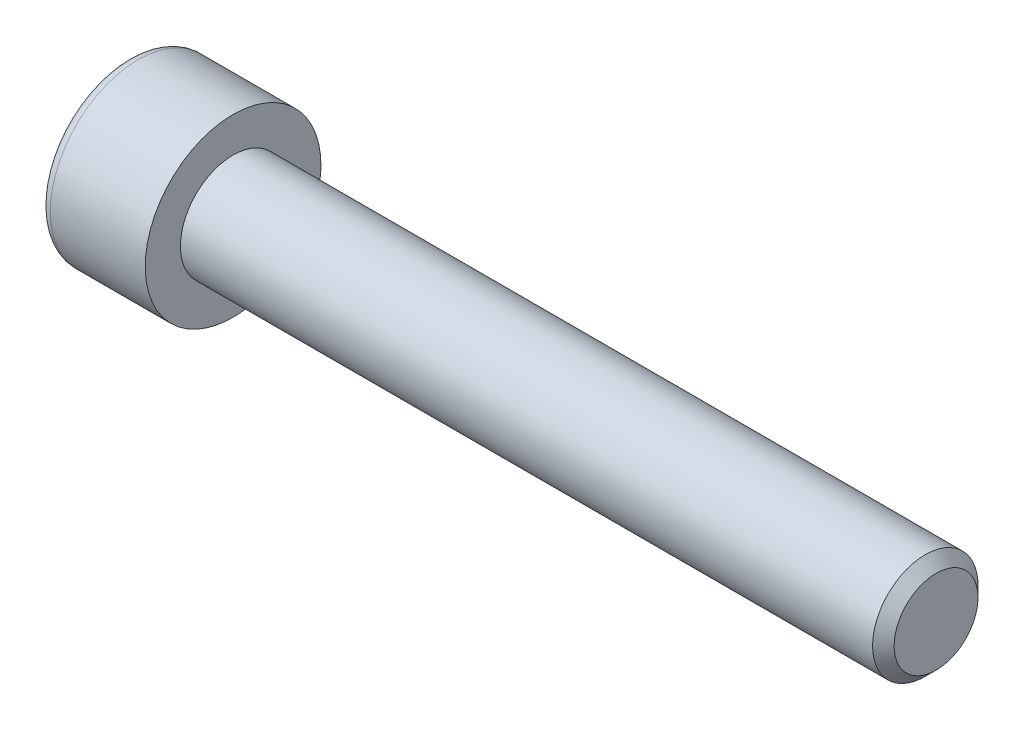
ISO-10303-21;
HEADER;
FILE_DESCRIPTION(('STEP AP214'),'2;1');
FILE_NAME('part.step','',(''),(''),'','','');
FILE_SCHEMA(('AUTOMOTIVE_DESIGN { 1 0 10303 214 1 1 1 1 }'));
ENDSEC;
DATA;
#1=APPLICATION_CONTEXT('core data for automotive mechanical design processes');
#2=APPLICATION_PROTOCOL_DEFINITION('international standard','automotive_design',2000,#1);
#3=PRODUCT_CONTEXT('',#1,'mechanical');
#4=PRODUCT('Part','Part','',(#3));
#5=PRODUCT_RELATED_PRODUCT_CATEGORY('part','',(#4));
#6=PRODUCT_DEFINITION_FORMATION('','',#4);
#7=PRODUCT_DEFINITION_CONTEXT('part definition',#1,'design');
#8=PRODUCT_DEFINITION('design','',#6,#7);
#9=PRODUCT_DEFINITION_SHAPE('','',#8);
#10=(LENGTH_UNIT() NAMED_UNIT(*) SI_UNIT(.MILLI.,.METRE.));
#11=(NAMED_UNIT(*) PLANE_ANGLE_UNIT() SI_UNIT($,.RADIAN.));
#12=(NAMED_UNIT(*) SI_UNIT($,.STERADIAN.) SOLID_ANGLE_UNIT());
#13=UNCERTAINTY_MEASURE_WITH_UNIT(LENGTH_MEASURE(1.E-05),#10,'distance_accuracy_value','');
#14=(GEOMETRIC_REPRESENTATION_CONTEXT(3) GLOBAL_UNCERTAINTY_ASSIGNED_CONTEXT((#13)) GLOBAL_UNIT_ASSIGNED_CONTEXT((#10,
#11,#12)) REPRESENTATION_CONTEXT('',''));
#15=CARTESIAN_POINT('',(0.,0.,0.));
#16=DIRECTION('',(0.,0.,1.));
#17=DIRECTION('',(1.,0.,0.));
#18=AXIS2_PLACEMENT_3D('',#15,#16,#17);
#19=CARTESIAN_POINT('',(-1.33333333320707,-2.27373675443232E-10,0.));
#20=DIRECTION('',(-1.,0.,0.));
#21=DIRECTION('',(0.,0.,1.));
#22=AXIS2_PLACEMENT_3D('',#19,#20,#21);
#23=CONICAL_SURFACE('',#22,0.,1.04719755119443);
#24=CARTESIAN_POINT('',(-1.33333333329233,-2.55795384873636E-10,0.));
#25=VERTEX_POINT('',#24);
#26=VERTEX_LOOP('',#25);
#27=FACE_BOUND('',#26,.T.);
#28=CARTESIAN_POINT('',(-2.99999999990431,3.48197362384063E-11,-2.88675134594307));
#29=CARTESIAN_POINT('',(-2.9633694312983,-0.109859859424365,-2.8233237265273));
#30=CARTESIAN_POINT('',(-2.93005584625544,-0.220668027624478,-2.75934860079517));
#31=CARTESIAN_POINT('',(-2.8719079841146,-0.444202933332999,-2.63029066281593));
#32=CARTESIAN_POINT('',(-2.8470942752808,-0.556933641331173,-2.56520555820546));
#33=CARTESIAN_POINT('',(-2.80846994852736,-0.780998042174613,-2.43584191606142));
#34=CARTESIAN_POINT('',(-2.79440223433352,-0.892297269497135,-2.37158327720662));
#35=CARTESIAN_POINT('',(-2.77761145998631,-1.11541915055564,-2.24276379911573));
#36=CARTESIAN_POINT('',(-2.77487449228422,-1.22724099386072,-2.17820342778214));
#37=CARTESIAN_POINT('',(-2.78058286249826,-1.43616811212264,-2.05757929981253));
#38=CARTESIAN_POINT('',(-2.78762660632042,-1.53330473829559,-2.00149744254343));
#39=CARTESIAN_POINT('',(-2.8099466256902,-1.72694517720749,-1.88969908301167));
#40=CARTESIAN_POINT('',(-2.8252305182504,-1.82344832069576,-1.83398296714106));
#41=CARTESIAN_POINT('',(-2.86343729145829,-2.01748767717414,-1.72195429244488));
#42=CARTESIAN_POINT('',(-2.88652205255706,-2.11499934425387,-1.66565590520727));
#43=CARTESIAN_POINT('',(-2.93891470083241,-2.30856871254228,-1.5538985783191));
#44=CARTESIAN_POINT('',(-2.96821028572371,-2.40462889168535,-1.49843820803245));
#45=CARTESIAN_POINT('',(-2.99999999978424,-2.50000000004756,-1.44337567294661));
#46=B_SPLINE_CURVE_WITH_KNOTS('',3,(#28,#29,#30,#31,#32,#33,#34,#35,#36,#37,#38,#39,#40,#41,#42,
#43,#44,#45),.UNSPECIFIED.,.F.,.F.,(4,2,2,2,2,2,2,2,4),(0.,0.396270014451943,0.793492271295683,
1.18088450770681,1.5678011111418,1.9046347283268,2.24178024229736,2.58640202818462,
2.93034746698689),.UNSPECIFIED.);
#47=CARTESIAN_POINT('',(-2.99999999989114,0.,-2.88675134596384));
#48=VERTEX_POINT('',#47);
#49=CARTESIAN_POINT('',(-2.9999999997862,-2.50000000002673,-1.44337567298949));
#50=VERTEX_POINT('',#49);
#51=EDGE_CURVE('E125',#48,#50,#46,.T.);
#52=ORIENTED_EDGE('',*,*,#51,.T.);
#53=CARTESIAN_POINT('',(-2.99999999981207,-2.4999999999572,-1.44337567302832));
#54=CARTESIAN_POINT('',(-2.96579221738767,-2.49999999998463,-1.32488884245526));
#55=CARTESIAN_POINT('',(-2.93447402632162,-2.49999999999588,-1.20546467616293));
#56=CARTESIAN_POINT('',(-2.87912300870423,-2.50000000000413,-0.964676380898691));
#57=CARTESIAN_POINT('',(-2.85510648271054,-2.50000000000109,-0.843308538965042));
#58=CARTESIAN_POINT('',(-2.81648500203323,-2.49999999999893,-0.601934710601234));
#59=CARTESIAN_POINT('',(-2.80167413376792,-2.49999999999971,-0.481962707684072));
#60=CARTESIAN_POINT('',(-2.7817914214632,-2.50000000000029,-0.241326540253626));
#61=CARTESIAN_POINT('',(-2.77670900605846,-2.50000000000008,-0.120663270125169));
#62=CARTESIAN_POINT('',(-2.7767090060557,-2.49999999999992,0.120663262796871));
#63=CARTESIAN_POINT('',(-2.78179142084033,-2.49999999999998,0.241326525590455));
#64=CARTESIAN_POINT('',(-2.80167413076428,-2.50000000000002,0.481962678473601));
#65=CARTESIAN_POINT('',(-2.81648499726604,-2.50000000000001,0.601934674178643));
#66=CARTESIAN_POINT('',(-2.85510647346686,-2.49999999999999,0.843308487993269));
#67=CARTESIAN_POINT('',(-2.87912299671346,-2.5,0.96467632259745));
#68=CARTESIAN_POINT('',(-2.9344740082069,-2.5,1.2054646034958));
#69=CARTESIAN_POINT('',(-2.96579219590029,-2.50000000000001,1.32488876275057));
#70=CARTESIAN_POINT('',(-2.99999997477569,-2.5,1.44337558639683));
#71=B_SPLINE_CURVE_WITH_KNOTS('',3,(#53,#54,#55,#56,#57,#58,#59,#60,#61,#62,#63,#64,#65,#66,#67,
#68,#69,#70),.UNSPECIFIED.,.F.,.F.,(4,2,2,2,2,2,2,2,4),(0.,0.370091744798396,0.741003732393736,
1.10328857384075,1.46517951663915,1.82707043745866,2.18935525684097,2.56026722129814,
2.93035894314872),.UNSPECIFIED.);
#72=CARTESIAN_POINT('',(-2.99999999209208,-2.50000001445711,1.44337562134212));
#73=VERTEX_POINT('',#72);
#74=EDGE_CURVE('E271',#50,#73,#71,.T.);
#75=ORIENTED_EDGE('',*,*,#74,.T.);
#76=CARTESIAN_POINT('',(-3.00000000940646,-2.50000002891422,1.44337565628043));
#77=CARTESIAN_POINT('',(-2.96336944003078,-2.39014016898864,1.5068032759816));
#78=CARTESIAN_POINT('',(-2.93005585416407,-2.27933200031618,1.57077840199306));
#79=CARTESIAN_POINT('',(-2.87190799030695,-2.05579709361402,1.69983634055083));
#80=CARTESIAN_POINT('',(-2.84709428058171,-1.94306638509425,1.76492144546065));
#81=CARTESIAN_POINT('',(-2.8084699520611,-1.71900198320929,1.89428508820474));
#82=CARTESIAN_POINT('',(-2.79440223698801,-1.60770275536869,1.95854372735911));
#83=CARTESIAN_POINT('',(-2.77761146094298,-1.38458087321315,2.08736320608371));
#84=CARTESIAN_POINT('',(-2.7748744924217,-1.27275902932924,2.15192357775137));
#85=CARTESIAN_POINT('',(-2.78058286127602,-1.06383190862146,2.27254770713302));
#86=CARTESIAN_POINT('',(-2.78762660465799,-0.966695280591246,2.32862956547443));
#87=CARTESIAN_POINT('',(-2.80994662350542,-0.773054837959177,2.44042792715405));
#88=CARTESIAN_POINT('',(-2.82523051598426,-0.676551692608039,2.49614404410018));
#89=CARTESIAN_POINT('',(-2.86343728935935,-0.482512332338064,2.60817272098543));
#90=CARTESIAN_POINT('',(-2.88652205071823,-0.385000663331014,2.66447110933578));
#91=CARTESIAN_POINT('',(-2.93891469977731,-0.191431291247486,2.77622843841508));
#92=CARTESIAN_POINT('',(-2.96821028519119,-0.0953711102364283,2.83168880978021));
#93=CARTESIAN_POINT('',(-2.9999999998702,-3.56160262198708E-11,2.88675134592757));
#94=B_SPLINE_CURVE_WITH_KNOTS('',3,(#76,#77,#78,#79,#80,#81,#82,#83,#84,#85,#86,#87,#88,#89,#90,
#91,#92,#93),.UNSPECIFIED.,.F.,.F.,(4,2,2,2,2,2,2,2,4),(0.,0.396270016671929,0.793492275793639,
1.18088451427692,1.56780111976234,1.90463474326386,2.24178026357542,2.58640205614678,
2.93034750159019),.UNSPECIFIED.);
#95=CARTESIAN_POINT('',(-2.99999999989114,-6.29652373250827E-11,2.88675134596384));
#96=VERTEX_POINT('',#95);
#97=EDGE_CURVE('E279',#73,#96,#94,.T.);
#98=ORIENTED_EDGE('',*,*,#97,.T.);
#99=CARTESIAN_POINT('',(-2.99999999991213,-9.01837214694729E-11,2.8867513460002));
#100=CARTESIAN_POINT('',(-2.96336943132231,0.109859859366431,2.82332372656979));
#101=CARTESIAN_POINT('',(-2.93005584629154,0.220668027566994,2.75934860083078));
#102=CARTESIAN_POINT('',(-2.87190798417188,0.444202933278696,2.63029066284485));
#103=CARTESIAN_POINT('',(-2.84709427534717,0.556933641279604,2.56520555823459));
#104=CARTESIAN_POINT('',(-2.80846994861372,0.780998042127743,2.4358419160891));
#105=CARTESIAN_POINT('',(-2.79440223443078,0.892297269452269,2.37158327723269));
#106=CARTESIAN_POINT('',(-2.77761146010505,1.11541915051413,2.24276379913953));
#107=CARTESIAN_POINT('',(-2.77487449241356,1.22724099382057,2.17820342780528));
#108=CARTESIAN_POINT('',(-2.78058286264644,1.43616811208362,2.05757929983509));
#109=CARTESIAN_POINT('',(-2.78762660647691,1.53330473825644,2.00149744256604));
#110=CARTESIAN_POINT('',(-2.80994662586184,1.72694517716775,1.8896990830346));
#111=CARTESIAN_POINT('',(-2.8252305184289,1.82344832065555,1.83398296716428));
#112=CARTESIAN_POINT('',(-2.86343729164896,2.01748767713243,1.72195429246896));
#113=CARTESIAN_POINT('',(-2.88652205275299,2.11499934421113,1.66565590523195));
#114=CARTESIAN_POINT('',(-2.93891470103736,2.30856871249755,1.55389857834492));
#115=CARTESIAN_POINT('',(-2.96821028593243,2.40462889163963,1.49843820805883));
#116=CARTESIAN_POINT('',(-2.99999999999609,2.50000000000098,1.44337567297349));
#117=B_SPLINE_CURVE_WITH_KNOTS('',3,(#99,#100,#101,#102,#103,#104,#105,#106,#107,#108,#109,#110,
#111,#112,#113,#114,#115,#116),.UNSPECIFIED.,.F.,.F.,(4,2,2,2,2,2,2,2,4),(0.,0.396270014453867,
0.793492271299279,1.18088450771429,1.56780111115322,1.90463472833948,2.24178024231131,
2.58640202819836,2.93034746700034),.UNSPECIFIED.);
#118=CARTESIAN_POINT('',(-2.99999999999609,2.50000000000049,1.44337567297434));
#119=VERTEX_POINT('',#118);
#120=EDGE_CURVE('E282',#96,#119,#117,.T.);
#121=ORIENTED_EDGE('',*,*,#120,.T.);
#122=CARTESIAN_POINT('',(-2.99999999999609,2.5,1.4433756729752));
#123=CARTESIAN_POINT('',(-2.96579221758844,2.5,1.32488884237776));
#124=CARTESIAN_POINT('',(-2.93447402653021,2.5,1.20546467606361));
#125=CARTESIAN_POINT('',(-2.87912300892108,2.5,0.964676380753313));
#126=CARTESIAN_POINT('',(-2.85510648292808,2.5,0.843308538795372));
#127=CARTESIAN_POINT('',(-2.81648500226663,2.5,0.601934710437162));
#128=CARTESIAN_POINT('',(-2.80167413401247,2.5,0.481962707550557));
#129=CARTESIAN_POINT('',(-2.78179142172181,2.5,0.241326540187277));
#130=CARTESIAN_POINT('',(-2.77670900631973,2.5,0.120663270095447));
#131=CARTESIAN_POINT('',(-2.77670900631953,2.5,-0.12066327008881));
#132=CARTESIAN_POINT('',(-2.78179142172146,2.5,-0.241326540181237));
#133=CARTESIAN_POINT('',(-2.80167413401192,2.5,-0.481962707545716));
#134=CARTESIAN_POINT('',(-2.81648500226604,2.5,-0.601934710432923));
#135=CARTESIAN_POINT('',(-2.8551064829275,2.5,-0.843308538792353));
#136=CARTESIAN_POINT('',(-2.87912300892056,2.5,-0.964676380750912));
#137=CARTESIAN_POINT('',(-2.9344740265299,2.5,-1.20546467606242));
#138=CARTESIAN_POINT('',(-2.96579221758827,2.5,-1.32488884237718));
#139=CARTESIAN_POINT('',(-2.99999999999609,2.5,-1.4433756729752));
#140=B_SPLINE_CURVE_WITH_KNOTS('',3,(#122,#123,#124,#125,#126,#127,#128,#129,#130,#131,#132,
#133,#134,#135,#136,#137,#138,#139),.UNSPECIFIED.,.F.,.F.,(4,2,2,2,2,2,2,2,4),(0.,
0.370091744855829,0.741003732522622,1.10328857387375,1.46517951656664,1.82707045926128,
2.18935530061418,2.56026728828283,2.9303590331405),.UNSPECIFIED.);
#141=CARTESIAN_POINT('',(-2.99999999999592,2.5,-1.44337567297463));
#142=VERTEX_POINT('',#141);
#143=EDGE_CURVE('E21',#119,#142,#140,.T.);
#144=ORIENTED_EDGE('',*,*,#143,.T.);
#145=CARTESIAN_POINT('',(-2.99999999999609,2.50000000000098,-1.4433756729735));
#146=CARTESIAN_POINT('',(-2.96336943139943,2.3901401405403,-1.50680329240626));
#147=CARTESIAN_POINT('',(-2.93005584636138,2.27933197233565,-1.57077841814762));
#148=CARTESIAN_POINT('',(-2.8719079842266,2.05579706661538,-1.6998363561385));
#149=CARTESIAN_POINT('',(-2.84709427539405,1.94306635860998,-1.76492146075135));
#150=CARTESIAN_POINT('',(-2.80846994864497,1.71900195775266,-1.89428510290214));
#151=CARTESIAN_POINT('',(-2.79440223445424,1.60770273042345,-1.95854374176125));
#152=CARTESIAN_POINT('',(-2.7776114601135,1.38458084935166,-2.08736321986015));
#153=CARTESIAN_POINT('',(-2.77487449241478,1.27275900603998,-2.15192359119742));
#154=CARTESIAN_POINT('',(-2.78058286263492,1.06383188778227,-2.27254771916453));
#155=CARTESIAN_POINT('',(-2.78762660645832,0.966695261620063,-2.32862957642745));
#156=CARTESIAN_POINT('',(-2.80994662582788,0.773054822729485,-2.44042793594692));
#157=CARTESIAN_POINT('',(-2.82523051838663,0.676551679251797,-2.49614405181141));
#158=CARTESIAN_POINT('',(-2.86343729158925,0.482512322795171,-2.60817272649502));
#159=CARTESIAN_POINT('',(-2.88652205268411,0.385000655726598,-2.66447111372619));
#160=CARTESIAN_POINT('',(-2.93891470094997,0.191431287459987,-2.77622844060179));
#161=CARTESIAN_POINT('',(-2.9682102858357,0.0953711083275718,-2.83168881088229));
#162=CARTESIAN_POINT('',(-2.99999999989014,-2.42180972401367E-11,-2.88675134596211));
#163=B_SPLINE_CURVE_WITH_KNOTS('',3,(#145,#146,#147,#148,#149,#150,#151,#152,#153,#154,#155,
#156,#157,#158,#159,#160,#161,#162),.UNSPECIFIED.,.F.,.F.,(4,2,2,2,2,2,2,2,4),(0.,
0.396270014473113,0.793492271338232,1.18088450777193,1.56780111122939,1.90463472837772,
2.2417802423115,2.58640202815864,2.93034746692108),.UNSPECIFIED.);
#164=EDGE_CURVE('E91',#142,#48,#163,.T.);
#165=ORIENTED_EDGE('',*,*,#164,.T.);
#166=EDGE_LOOP('',(#52,#75,#98,#121,#144,#165));
#167=FACE_BOUND('',#166,.T.);
#168=ADVANCED_FACE('F17',(#27,#167),#23,.F.);
#169=CARTESIAN_POINT('',(-6.,2.5,1.44337567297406));
#170=DIRECTION('',(0.,1.,0.));
#171=DIRECTION('',(0.,0.,1.));
#172=AXIS2_PLACEMENT_3D('',#169,#170,#171);
#173=PLANE('',#172);
#174=DIRECTION('',(1.,0.,0.));
#175=VECTOR('',#174,1.);
#176=CARTESIAN_POINT('',(-6.,2.5,1.44337567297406));
#177=LINE('',#176,#175);
#178=CARTESIAN_POINT('',(-6.,2.5,1.44337567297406));
#179=VERTEX_POINT('',#178);
#180=EDGE_CURVE('E85',#119,#179,#177,.F.);
#181=ORIENTED_EDGE('',*,*,#180,.T.);
#182=DIRECTION('',(0.,0.,1.));
#183=VECTOR('',#182,1.);
#184=CARTESIAN_POINT('',(-6.,2.5,0.));
#185=LINE('',#184,#183);
#186=CARTESIAN_POINT('',(-6.,2.5,-1.44337567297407));
#187=VERTEX_POINT('',#186);
#188=EDGE_CURVE('E79',#187,#179,#185,.T.);
#189=ORIENTED_EDGE('',*,*,#188,.F.);
#190=DIRECTION('',(1.,0.,0.));
#191=VECTOR('',#190,1.);
#192=CARTESIAN_POINT('',(-6.,2.5,-1.44337567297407));
#193=LINE('',#192,#191);
#194=EDGE_CURVE('E82',#187,#142,#193,.T.);
#195=ORIENTED_EDGE('',*,*,#194,.T.);
#196=ORIENTED_EDGE('',*,*,#143,.F.);
#197=EDGE_LOOP('',(#181,#189,#195,#196));
#198=FACE_BOUND('',#197,.T.);
#199=ADVANCED_FACE('F81',(#198),#173,.F.);
#200=CARTESIAN_POINT('',(-6.,0.,2.88675134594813));
#201=DIRECTION('',(0.,0.500000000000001,0.866025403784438));
#202=DIRECTION('',(0.,-0.866025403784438,0.500000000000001));
#203=AXIS2_PLACEMENT_3D('',#200,#201,#202);
#204=PLANE('',#203);
#205=DIRECTION('',(1.,0.,0.));
#206=VECTOR('',#205,1.);
#207=CARTESIAN_POINT('',(-6.,0.,2.88675134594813));
#208=LINE('',#207,#206);
#209=CARTESIAN_POINT('',(-6.,0.,2.88675134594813));
#210=VERTEX_POINT('',#209);
#211=EDGE_CURVE('E280',#96,#210,#208,.F.);
#212=ORIENTED_EDGE('',*,*,#211,.T.);
#213=DIRECTION('',(0.,-0.866025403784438,0.500000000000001));
#214=VECTOR('',#213,1.);
#215=CARTESIAN_POINT('',(-6.,2.5,1.44337567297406));
#216=LINE('',#215,#214);
#217=EDGE_CURVE('E90',#179,#210,#216,.T.);
#218=ORIENTED_EDGE('',*,*,#217,.F.);
#219=ORIENTED_EDGE('',*,*,#180,.F.);
#220=ORIENTED_EDGE('',*,*,#120,.F.);
#221=EDGE_LOOP('',(#212,#218,#219,#220));
#222=FACE_BOUND('',#221,.T.);
#223=ADVANCED_FACE('F246',(#222),#204,.F.);
#224=CARTESIAN_POINT('',(-6.,-2.5,1.44337567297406));
#225=DIRECTION('',(0.,-0.5,0.866025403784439));
#226=DIRECTION('',(0.,-0.866025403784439,-0.5));
#227=AXIS2_PLACEMENT_3D('',#224,#225,#226);
#228=PLANE('',#227);
#229=DIRECTION('',(1.,0.,0.));
#230=VECTOR('',#229,1.);
#231=CARTESIAN_POINT('',(-6.,-2.5,1.44337567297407));
#232=LINE('',#231,#230);
#233=CARTESIAN_POINT('',(-6.,-2.5,1.44337567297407));
#234=VERTEX_POINT('',#233);
#235=EDGE_CURVE('E276',#73,#234,#232,.F.);
#236=ORIENTED_EDGE('',*,*,#235,.T.);
#237=DIRECTION('',(0.,-0.866025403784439,-0.5));
#238=VECTOR('',#237,1.);
#239=CARTESIAN_POINT('',(-6.,0.,2.88675134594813));
#240=LINE('',#239,#238);
#241=EDGE_CURVE('E110',#210,#234,#240,.T.);
#242=ORIENTED_EDGE('',*,*,#241,.F.);
#243=ORIENTED_EDGE('',*,*,#211,.F.);
#244=ORIENTED_EDGE('',*,*,#97,.F.);
#245=EDGE_LOOP('',(#236,#242,#243,#244));
#246=FACE_BOUND('',#245,.T.);
#247=ADVANCED_FACE('F239',(#246),#228,.F.);
#248=CARTESIAN_POINT('',(-6.,-2.5,-1.44337567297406));
#249=DIRECTION('',(0.,-1.,0.));
#250=DIRECTION('',(0.,0.,-1.));
#251=AXIS2_PLACEMENT_3D('',#248,#249,#250);
#252=PLANE('',#251);
#253=DIRECTION('',(1.,0.,0.));
#254=VECTOR('',#253,1.);
#255=CARTESIAN_POINT('',(-6.,-2.5,-1.44337567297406));
#256=LINE('',#255,#254);
#257=CARTESIAN_POINT('',(-6.,-2.5,-1.44337567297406));
#258=VERTEX_POINT('',#257);
#259=EDGE_CURVE('E273',#50,#258,#256,.F.);
#260=ORIENTED_EDGE('',*,*,#259,.T.);
#261=DIRECTION('',(0.,0.,1.));
#262=VECTOR('',#261,1.);
#263=CARTESIAN_POINT('',(-6.,-2.5,0.));
#264=LINE('',#263,#262);
#265=EDGE_CURVE('E105',#234,#258,#264,.F.);
#266=ORIENTED_EDGE('',*,*,#265,.F.);
#267=ORIENTED_EDGE('',*,*,#235,.F.);
#268=ORIENTED_EDGE('',*,*,#74,.F.);
#269=EDGE_LOOP('',(#260,#266,#267,#268));
#270=FACE_BOUND('',#269,.T.);
#271=ADVANCED_FACE('F233',(#270),#252,.F.);
#272=CARTESIAN_POINT('',(-6.,0.,-2.88675134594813));
#273=DIRECTION('',(0.,-0.5,-0.866025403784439));
#274=DIRECTION('',(0.,0.866025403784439,-0.5));
#275=AXIS2_PLACEMENT_3D('',#272,#273,#274);
#276=PLANE('',#275);
#277=DIRECTION('',(1.,0.,0.));
#278=VECTOR('',#277,1.);
#279=CARTESIAN_POINT('',(-6.,0.,-2.88675134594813));
#280=LINE('',#279,#278);
#281=CARTESIAN_POINT('',(-6.,0.,-2.88675134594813));
#282=VERTEX_POINT('',#281);
#283=EDGE_CURVE('E41',#48,#282,#280,.F.);
#284=ORIENTED_EDGE('',*,*,#283,.T.);
#285=DIRECTION('',(0.,0.866025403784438,-0.5));
#286=VECTOR('',#285,1.);
#287=CARTESIAN_POINT('',(-6.,-2.5,-1.44337567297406));
#288=LINE('',#287,#286);
#289=EDGE_CURVE('E100',#258,#282,#288,.T.);
#290=ORIENTED_EDGE('',*,*,#289,.F.);
#291=ORIENTED_EDGE('',*,*,#259,.F.);
#292=ORIENTED_EDGE('',*,*,#51,.F.);
#293=EDGE_LOOP('',(#284,#290,#291,#292));
#294=FACE_BOUND('',#293,.T.);
#295=ADVANCED_FACE('F135',(#294),#276,.F.);
#296=CARTESIAN_POINT('',(-6.,2.5,-1.44337567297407));
#297=DIRECTION('',(0.,0.5,-0.866025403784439));
#298=DIRECTION('',(0.,0.866025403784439,0.5));
#299=AXIS2_PLACEMENT_3D('',#296,#297,#298);
#300=PLANE('',#299);
#301=ORIENTED_EDGE('',*,*,#194,.F.);
#302=DIRECTION('',(0.,0.866025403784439,0.5));
#303=VECTOR('',#302,1.);
#304=CARTESIAN_POINT('',(-6.,0.,-2.88675134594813));
#305=LINE('',#304,#303);
#306=EDGE_CURVE('E95',#282,#187,#305,.T.);
#307=ORIENTED_EDGE('',*,*,#306,.F.);
#308=ORIENTED_EDGE('',*,*,#283,.F.);
#309=ORIENTED_EDGE('',*,*,#164,.F.);
#310=EDGE_LOOP('',(#301,#307,#308,#309));
#311=FACE_BOUND('',#310,.T.);
#312=ADVANCED_FACE('F94',(#311),#300,.F.);
#313=CARTESIAN_POINT('',(-6.,3.94337567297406,0.));
#314=DIRECTION('',(-1.,0.,0.));
#315=DIRECTION('',(0.,-1.,0.));
#316=AXIS2_PLACEMENT_3D('',#313,#314,#315);
#317=PLANE('',#316);
#318=CARTESIAN_POINT('',(-6.,0.,0.));
#319=DIRECTION('',(1.,0.,0.));
#320=DIRECTION('',(0.,1.,0.));
#321=AXIS2_PLACEMENT_3D('',#318,#319,#320);
#322=CIRCLE('',#321,4.4);
#323=CARTESIAN_POINT('',(-6.,4.4,0.));
#324=VERTEX_POINT('',#323);
#325=EDGE_CURVE('E101',#324,#324,#322,.T.);
#326=ORIENTED_EDGE('',*,*,#325,.F.);
#327=EDGE_LOOP('',(#326));
#328=FACE_BOUND('',#327,.T.);
#329=ORIENTED_EDGE('',*,*,#289,.T.);
#330=ORIENTED_EDGE('',*,*,#306,.T.);
#331=ORIENTED_EDGE('',*,*,#188,.T.);
#332=ORIENTED_EDGE('',*,*,#217,.T.);
#333=ORIENTED_EDGE('',*,*,#241,.T.);
#334=ORIENTED_EDGE('',*,*,#265,.T.);
#335=EDGE_LOOP('',(#329,#330,#331,#332,#333,#334));
#336=FACE_BOUND('',#335,.T.);
#337=ADVANCED_FACE('F98',(#328,#336),#317,.T.);
#338=CARTESIAN_POINT('',(-5.4,0.,0.));
#339=DIRECTION('',(1.,0.,0.));
#340=DIRECTION('',(0.,0.,-1.));
#341=AXIS2_PLACEMENT_3D('',#338,#339,#340);
#342=TOROIDAL_SURFACE('',#341,4.4,0.6);
#343=CARTESIAN_POINT('',(-5.4,0.,0.));
#344=DIRECTION('',(1.,0.,0.));
#345=DIRECTION('',(0.,1.,0.));
#346=AXIS2_PLACEMENT_3D('',#343,#344,#345);
#347=CIRCLE('',#346,5.);
#348=CARTESIAN_POINT('',(-5.4,5.,0.));
#349=VERTEX_POINT('',#348);
#350=EDGE_CURVE('E104',#349,#349,#347,.T.);
#351=ORIENTED_EDGE('',*,*,#350,.F.);
#352=EDGE_LOOP('',(#351));
#353=FACE_BOUND('',#352,.T.);
#354=ORIENTED_EDGE('',*,*,#325,.T.);
#355=EDGE_LOOP('',(#354));
#356=FACE_BOUND('',#355,.T.);
#357=ADVANCED_FACE('F141',(#353,#356),#342,.T.);
#358=CARTESIAN_POINT('',(40.,1.5,0.));
#359=DIRECTION('',(1.,0.,0.));
#360=DIRECTION('',(0.,0.,-1.));
#361=AXIS2_PLACEMENT_3D('',#358,#359,#360);
#362=PLANE('',#361);
#363=CARTESIAN_POINT('',(39.9999999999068,0.,0.));
#364=DIRECTION('',(-1.,0.,0.));
#365=DIRECTION('',(0.,0.,1.));
#366=AXIS2_PLACEMENT_3D('',#363,#364,#365);
#367=CIRCLE('',#366,2.38654999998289);
#368=CARTESIAN_POINT('',(39.9999999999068,0.,2.38654999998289));
#369=VERTEX_POINT('',#368);
#370=EDGE_CURVE('E117',#369,#369,#367,.T.);
#371=ORIENTED_EDGE('',*,*,#370,.F.);
#372=EDGE_LOOP('',(#371));
#373=FACE_BOUND('',#372,.T.);
#374=ADVANCED_FACE('F172',(#373),#362,.T.);
#375=CARTESIAN_POINT('',(-3.,0.,0.));
#376=DIRECTION('',(1.,0.,0.));
#377=DIRECTION('',(0.,1.,0.));
#378=AXIS2_PLACEMENT_3D('',#375,#376,#377);
#379=CYLINDRICAL_SURFACE('',#378,5.);
#380=CARTESIAN_POINT('',(0.,0.,0.));
#381=DIRECTION('',(1.,0.,0.));
#382=DIRECTION('',(0.,1.,0.));
#383=AXIS2_PLACEMENT_3D('',#380,#381,#382);
#384=CIRCLE('',#383,5.);
#385=CARTESIAN_POINT('',(0.,5.,0.));
#386=VERTEX_POINT('',#385);
#387=EDGE_CURVE('E114',#386,#386,#384,.T.);
#388=ORIENTED_EDGE('',*,*,#387,.F.);
#389=EDGE_LOOP('',(#388));
#390=FACE_BOUND('',#389,.T.);
#391=ORIENTED_EDGE('',*,*,#350,.T.);
#392=EDGE_LOOP('',(#391));
#393=FACE_BOUND('',#392,.T.);
#394=ADVANCED_FACE('F178',(#390,#393),#379,.T.);
#395=CARTESIAN_POINT('',(39.3865499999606,0.,0.));
#396=DIRECTION('',(-1.,0.,0.));
#397=DIRECTION('',(0.,0.,1.));
#398=AXIS2_PLACEMENT_3D('',#395,#396,#397);
#399=CONICAL_SURFACE('',#398,2.99999999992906,0.785398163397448);
#400=CARTESIAN_POINT('',(39.38655,0.,0.));
#401=DIRECTION('',(1.,0.,0.));
#402=DIRECTION('',(0.,1.,0.));
#403=AXIS2_PLACEMENT_3D('',#400,#401,#402);
#404=CIRCLE('',#403,3.);
#405=CARTESIAN_POINT('',(39.38655,3.,0.));
#406=VERTEX_POINT('',#405);
#407=EDGE_CURVE('E32',#406,#406,#404,.F.);
#408=ORIENTED_EDGE('',*,*,#407,.F.);
#409=EDGE_LOOP('',(#408));
#410=FACE_BOUND('',#409,.T.);
#411=ORIENTED_EDGE('',*,*,#370,.T.);
#412=EDGE_LOOP('',(#411));
#413=FACE_BOUND('',#412,.T.);
#414=ADVANCED_FACE('F187',(#410,#413),#399,.T.);
#415=CARTESIAN_POINT('',(0.,4.,0.));
#416=DIRECTION('',(1.,0.,0.));
#417=DIRECTION('',(0.,0.,-1.));
#418=AXIS2_PLACEMENT_3D('',#415,#416,#417);
#419=PLANE('',#418);
#420=ORIENTED_EDGE('',*,*,#387,.T.);
#421=EDGE_LOOP('',(#420));
#422=FACE_BOUND('',#421,.T.);
#423=CARTESIAN_POINT('',(0.,0.,0.));
#424=DIRECTION('',(1.,0.,0.));
#425=DIRECTION('',(0.,1.,0.));
#426=AXIS2_PLACEMENT_3D('',#423,#424,#425);
#427=CIRCLE('',#426,3.);
#428=CARTESIAN_POINT('',(0.,3.,0.));
#429=VERTEX_POINT('',#428);
#430=EDGE_CURVE('E11',#429,#429,#427,.T.);
#431=ORIENTED_EDGE('',*,*,#430,.F.);
#432=EDGE_LOOP('',(#431));
#433=FACE_BOUND('',#432,.T.);
#434=ADVANCED_FACE('F182',(#422,#433),#419,.T.);
#435=CARTESIAN_POINT('',(28.,0.,0.));
#436=DIRECTION('',(1.,0.,0.));
#437=DIRECTION('',(0.,1.,0.));
#438=AXIS2_PLACEMENT_3D('',#435,#436,#437);
#439=CYLINDRICAL_SURFACE('',#438,3.);
#440=ORIENTED_EDGE('',*,*,#407,.T.);
#441=EDGE_LOOP('',(#440));
#442=FACE_BOUND('',#441,.T.);
#443=ORIENTED_EDGE('',*,*,#430,.T.);
#444=EDGE_LOOP('',(#443));
#445=FACE_BOUND('',#444,.T.);
#446=ADVANCED_FACE('F19',(#442,#445),#439,.T.);
#447=CLOSED_SHELL('',(#168,#199,#223,#247,#271,#295,#312,#337,#357,#374,#394,#414,#434,#446));
#448=MANIFOLD_SOLID_BREP('B1',#447);
#449=ADVANCED_BREP_SHAPE_REPRESENTATION('',(#18,#448),#14);
#450=SHAPE_DEFINITION_REPRESENTATION(#9,#449);
ENDSEC;
END-ISO-10303-21;
